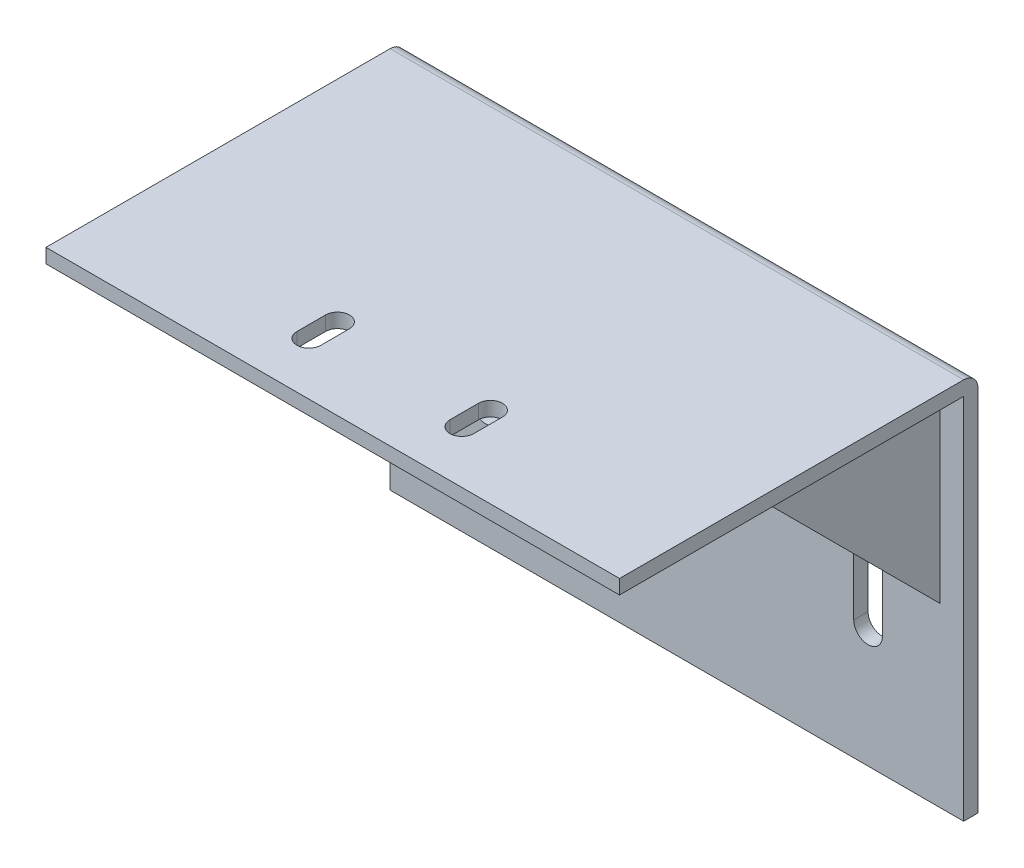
from build123d import *

# Parameters (mm, degrees)
ESQUISSE1_W             = 120
ESQUISSE1_H             = 80
BASE_EXTRUSION_DEPTH    = 3
ESQUISSE2_W             = 120
ESQUISSE2_H             = 3
BOSS_EXTRU_1_DEPTH      = 72
ENL_V_MAT_EXTRU_1_DEPTH = 3
ESQUISSE6_W             = 3
ESQUISSE6_H             = 40
BOSS_EXTRU_2_DEPTH      = 40
ENL_V_MAT_EXTRU_3_DEPTH = 3
ENL_V_MAT_EXTRU_5_DEPTH = 159.902485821
CONG_1_R                = 3


with BuildPart() as part:
    # Esquisse1 → Base-Extrusion (new body)
    with BuildSketch(Plane.XY):
        with Locations((60, 40)):
            Rectangle(ESQUISSE1_W, ESQUISSE1_H)
    extrude(amount=BASE_EXTRUSION_DEPTH)

    # Esquisse2 → Boss.-Extru.1 (add)
    with BuildSketch(Plane.XY.offset(3)):
        with Locations((60, 78.5)):
            Rectangle(ESQUISSE2_W, ESQUISSE2_H)
    extrude(amount=BOSS_EXTRU_1_DEPTH)

    # Esquisse5 → Enl_v. mat.-Extru.1 (cut)
    with BuildSketch(Plane.XY.offset(3)):
        with BuildLine():
            Line((17, 55), (17, 25))
            ThreePointArc((17, 25), (20, 22), (23, 25))
            Line((23, 25), (23, 55))
            ThreePointArc((23, 55), (20, 58), (17, 55))
        make_face()
        with BuildLine():
            Line((97, 55), (97, 25))
            ThreePointArc((97, 25), (100, 22), (103, 25))
            Line((103, 25), (103, 55))
            ThreePointArc((103, 55), (100, 58), (97, 55))
        make_face()
    extrude(amount=-ENL_V_MAT_EXTRU_1_DEPTH, mode=Mode.SUBTRACT)

    # Esquisse6 → Boss.-Extru.2 (add)
    with BuildSketch(Plane.XY.offset(3)):
        with Locations((6.5, 57)):
            Rectangle(ESQUISSE6_W, ESQUISSE6_H)
        with Locations((113.5, 57)):
            Rectangle(ESQUISSE6_W, ESQUISSE6_H)
    extrude(amount=BOSS_EXTRU_2_DEPTH)

    # Esquisse8 → Enl_v. mat.-Extru.3 (cut)
    with BuildSketch(Plane.XZ.offset(-77)):
        with BuildLine():
            Line((41.5, 64), (41.5, 58))
            ThreePointArc((41.5, 58), (44, 55.5), (46.5, 58))
            Line((46.5, 58), (46.5, 64))
            ThreePointArc((46.5, 64), (44, 66.5), (41.5, 64))
        make_face()
        with BuildLine():
            Line((73.5, 64), (73.5, 58))
            ThreePointArc((73.5, 58), (76, 55.5), (78.5, 58))
            Line((78.5, 58), (78.5, 64))
            ThreePointArc((78.5, 64), (76, 66.5), (73.5, 64))
        make_face()
    extrude(amount=-ENL_V_MAT_EXTRU_3_DEPTH, mode=Mode.SUBTRACT)

    # Esquisse10 → Enl_v. mat.-Extru.5 (cut, through all)
    with BuildSketch(Plane.ZY.offset(-5)):
        Polygon((3, 37), (43, 77), (43, 37), align=None)
    extrude(amount=-ENL_V_MAT_EXTRU_5_DEPTH, mode=Mode.SUBTRACT)

    # Cong_1
    cong_1_edges = [part.edges().sort_by_distance(p)[0] for p in [
        (60, 80, 0),
    ]]
    fillet(cong_1_edges, radius=CONG_1_R)


solid = part.part
